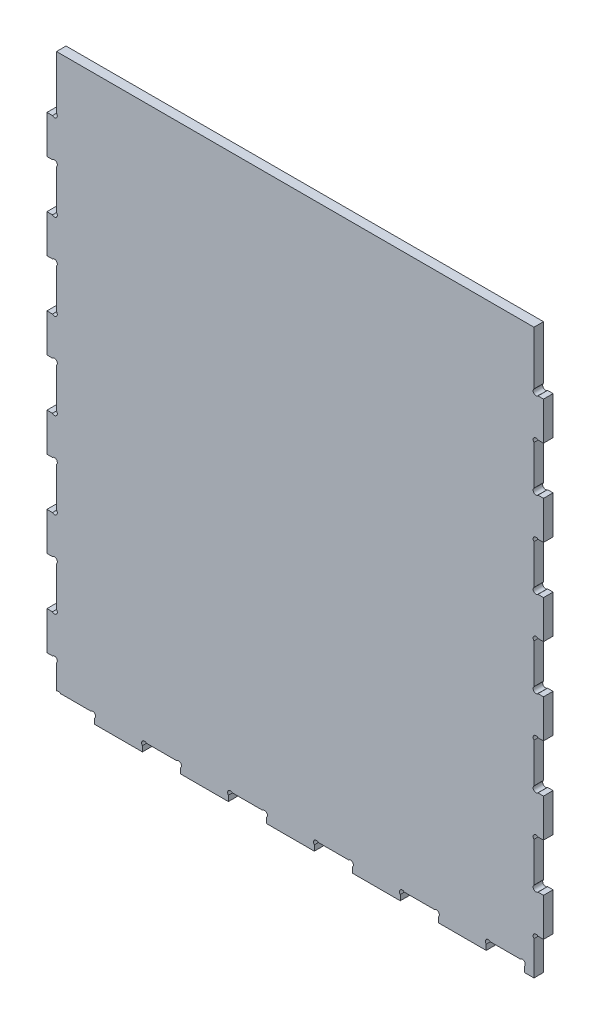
from build123d import *

# Parameters (mm, degrees)
CROQUIS1_W                 = 10
CROQUIS1_H                 = 590.213783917
SALIENTE_EXTRUIR1_DEPTH    = 500
CROQUIS2_W                 = 10
CROQUIS2_H                 = 40
SALIENTE_EXTRUIR2_DEPTH    = 10
CROQUIS3_R                 = 3
CORTAR_EXTRUIR1_DEPTH      = 781.097628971
MATRIZL1_COUNT             = 6
MATRIZL1_PITCH             = 90
SIMETR_A1_COPY_1_SKETCH_W  = 10
SIMETR_A1_COPY_1_SKETCH_H  = 40
SIMETR_A1_COPY_1_DEPTH     = 10
SIMETR_A1_COPY_2_SKETCH_W  = 10
SIMETR_A1_COPY_2_SKETCH_H  = 40
SIMETR_A1_COPY_2_DEPTH     = 10
SIMETR_A1_COPY_3_SKETCH_W  = 10
SIMETR_A1_COPY_3_SKETCH_H  = 40
SIMETR_A1_COPY_3_DEPTH     = 10
SIMETR_A1_COPY_4_SKETCH_W  = 10
SIMETR_A1_COPY_4_SKETCH_H  = 40
SIMETR_A1_COPY_4_DEPTH     = 10
SIMETR_A1_COPY_5_SKETCH_W  = 10
SIMETR_A1_COPY_5_SKETCH_H  = 40
SIMETR_A1_COPY_5_DEPTH     = 10
SIMETR_A1_COPY_6_SKETCH_R  = 3
SIMETR_A1_COPY_6_DEPTH     = 781.097628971
SIMETR_A1_COPY_7_SKETCH_R  = 3
SIMETR_A1_COPY_7_DEPTH     = 781.097628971
SIMETR_A1_COPY_8_SKETCH_R  = 3
SIMETR_A1_COPY_8_DEPTH     = 781.097628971
SIMETR_A1_COPY_9_SKETCH_R  = 3
SIMETR_A1_COPY_9_DEPTH     = 781.097628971
SIMETR_A1_COPY_10_SKETCH_R = 3
SIMETR_A1_COPY_10_DEPTH    = 781.097628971
CROQUIS4_W                 = 40
CROQUIS4_H                 = 10
CORTAR_EXTRUIR2_DEPTH      = 10
CROQUIS5_R                 = 3
CORTAR_EXTRUIR3_DEPTH      = 787.671666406
MATRIZL2_COUNT             = 6
MATRIZL2_PITCH             = 90


with BuildPart() as part:
    # Croquis1 → Saliente-Extruir1 (new body)
    with BuildSketch(Plane.ZY.offset(-510)):
        with Locations((-5, 295.106891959)):
            Rectangle(CROQUIS1_W, CROQUIS1_H)
    extrude(amount=SALIENTE_EXTRUIR1_DEPTH)

    # Croquis2 → Saliente-Extruir2 (add)
    with BuildSketch(Plane.XY):
        with Locations((5, 60)):
            Rectangle(CROQUIS2_W, CROQUIS2_H)
    saliente_extruir2 = extrude(amount=-SALIENTE_EXTRUIR2_DEPTH)

    # Croquis3 → Cortar-Extruir1 (cut, symmetric)
    with BuildSketch(Plane.XY):
        with Locations((7.878679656, 37.878679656)):
            Circle(CROQUIS3_R)
        with Locations((7.878679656, 82.121320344)):
            Circle(CROQUIS3_R)
    cortar_extruir1 = extrude(amount=CORTAR_EXTRUIR1_DEPTH, both=True, mode=Mode.SUBTRACT)

    # MatrizL1: Saliente-Extruir2, Cortar-Extruir1 ×6
    with Locations(*[(0, i * MATRIZL1_PITCH, 0) for i in range(1, MATRIZL1_COUNT)]):
        add(saliente_extruir2)
        add(cortar_extruir1, mode=Mode.SUBTRACT)

    # Simetr_a1: Saliente-Extruir2, Cortar-Extruir1 across plane
    add(saliente_extruir2.mirror(Plane.ZY.offset(-260)))
    add(cortar_extruir1.mirror(Plane.ZY.offset(-260)), mode=Mode.SUBTRACT)

    # Simetr_a1 copy 1 sketch → Simetr_a1 copy 1 (add)
    with BuildSketch(Plane(origin=(520, 90, 0), x_dir=(-1, 0, 0), z_dir=(0, 0, 1))):
        with Locations((5, -60)):
            Rectangle(SIMETR_A1_COPY_1_SKETCH_W, SIMETR_A1_COPY_1_SKETCH_H)
    extrude(amount=-SIMETR_A1_COPY_1_DEPTH)

    # Simetr_a1 copy 2 sketch → Simetr_a1 copy 2 (add)
    with BuildSketch(Plane(origin=(520, 180, 0), x_dir=(-1, 0, 0), z_dir=(0, 0, 1))):
        with Locations((5, -60)):
            Rectangle(SIMETR_A1_COPY_2_SKETCH_W, SIMETR_A1_COPY_2_SKETCH_H)
    extrude(amount=-SIMETR_A1_COPY_2_DEPTH)

    # Simetr_a1 copy 3 sketch → Simetr_a1 copy 3 (add)
    with BuildSketch(Plane(origin=(520, 270, 0), x_dir=(-1, 0, 0), z_dir=(0, 0, 1))):
        with Locations((5, -60)):
            Rectangle(SIMETR_A1_COPY_3_SKETCH_W, SIMETR_A1_COPY_3_SKETCH_H)
    extrude(amount=-SIMETR_A1_COPY_3_DEPTH)

    # Simetr_a1 copy 4 sketch → Simetr_a1 copy 4 (add)
    with BuildSketch(Plane(origin=(520, 360, 0), x_dir=(-1, 0, 0), z_dir=(0, 0, 1))):
        with Locations((5, -60)):
            Rectangle(SIMETR_A1_COPY_4_SKETCH_W, SIMETR_A1_COPY_4_SKETCH_H)
    extrude(amount=-SIMETR_A1_COPY_4_DEPTH)

    # Simetr_a1 copy 5 sketch → Simetr_a1 copy 5 (add)
    with BuildSketch(Plane(origin=(520, 450, 0), x_dir=(-1, 0, 0), z_dir=(0, 0, 1))):
        with Locations((5, -60)):
            Rectangle(SIMETR_A1_COPY_5_SKETCH_W, SIMETR_A1_COPY_5_SKETCH_H)
    extrude(amount=-SIMETR_A1_COPY_5_DEPTH)

    # Simetr_a1 copy 6 sketch → Simetr_a1 copy 6 (cut, symmetric)
    with BuildSketch(Plane(origin=(520, 90, 0), x_dir=(-1, 0, 0), z_dir=(0, 0, 1))):
        with Locations((7.878679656, -37.878679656)):
            Circle(SIMETR_A1_COPY_6_SKETCH_R)
        with Locations((7.878679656, -82.121320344)):
            Circle(SIMETR_A1_COPY_6_SKETCH_R)
    extrude(amount=SIMETR_A1_COPY_6_DEPTH, both=True, mode=Mode.SUBTRACT)

    # Simetr_a1 copy 7 sketch → Simetr_a1 copy 7 (cut, symmetric)
    with BuildSketch(Plane(origin=(520, 180, 0), x_dir=(-1, 0, 0), z_dir=(0, 0, 1))):
        with Locations((7.878679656, -37.878679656)):
            Circle(SIMETR_A1_COPY_7_SKETCH_R)
        with Locations((7.878679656, -82.121320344)):
            Circle(SIMETR_A1_COPY_7_SKETCH_R)
    extrude(amount=SIMETR_A1_COPY_7_DEPTH, both=True, mode=Mode.SUBTRACT)

    # Simetr_a1 copy 8 sketch → Simetr_a1 copy 8 (cut, symmetric)
    with BuildSketch(Plane(origin=(520, 270, 0), x_dir=(-1, 0, 0), z_dir=(0, 0, 1))):
        with Locations((7.878679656, -37.878679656)):
            Circle(SIMETR_A1_COPY_8_SKETCH_R)
        with Locations((7.878679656, -82.121320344)):
            Circle(SIMETR_A1_COPY_8_SKETCH_R)
    extrude(amount=SIMETR_A1_COPY_8_DEPTH, both=True, mode=Mode.SUBTRACT)

    # Simetr_a1 copy 9 sketch → Simetr_a1 copy 9 (cut, symmetric)
    with BuildSketch(Plane(origin=(520, 360, 0), x_dir=(-1, 0, 0), z_dir=(0, 0, 1))):
        with Locations((7.878679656, -37.878679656)):
            Circle(SIMETR_A1_COPY_9_SKETCH_R)
        with Locations((7.878679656, -82.121320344)):
            Circle(SIMETR_A1_COPY_9_SKETCH_R)
    extrude(amount=SIMETR_A1_COPY_9_DEPTH, both=True, mode=Mode.SUBTRACT)

    # Simetr_a1 copy 10 sketch → Simetr_a1 copy 10 (cut, symmetric)
    with BuildSketch(Plane(origin=(520, 450, 0), x_dir=(-1, 0, 0), z_dir=(0, 0, 1))):
        with Locations((7.878679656, -37.878679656)):
            Circle(SIMETR_A1_COPY_10_SKETCH_R)
        with Locations((7.878679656, -82.121320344)):
            Circle(SIMETR_A1_COPY_10_SKETCH_R)
    extrude(amount=SIMETR_A1_COPY_10_DEPTH, both=True, mode=Mode.SUBTRACT)

    # Croquis4 → Cortar-Extruir2 (cut)
    with BuildSketch(Plane.XY):
        with Locations((30, 5)):
            Rectangle(CROQUIS4_W, CROQUIS4_H)
    cortar_extruir2 = extrude(amount=-CORTAR_EXTRUIR2_DEPTH, mode=Mode.SUBTRACT)

    # Croquis5 → Cortar-Extruir3 (cut, symmetric)
    with BuildSketch(Plane.XY):
        with Locations((47.878679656, 7.878679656)):
            Circle(CROQUIS5_R)
        with Locations((12.121320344, 7.878679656)):
            Circle(CROQUIS5_R)
    cortar_extruir3 = extrude(amount=CORTAR_EXTRUIR3_DEPTH, both=True, mode=Mode.SUBTRACT)

    # MatrizL2: Cortar-Extruir2, Cortar-Extruir3 ×6
    with Locations(*[(i * MATRIZL2_PITCH, 0, 0) for i in range(1, MATRIZL2_COUNT)]):
        add(cortar_extruir2, mode=Mode.SUBTRACT)
        add(cortar_extruir3, mode=Mode.SUBTRACT)


solid = part.part
